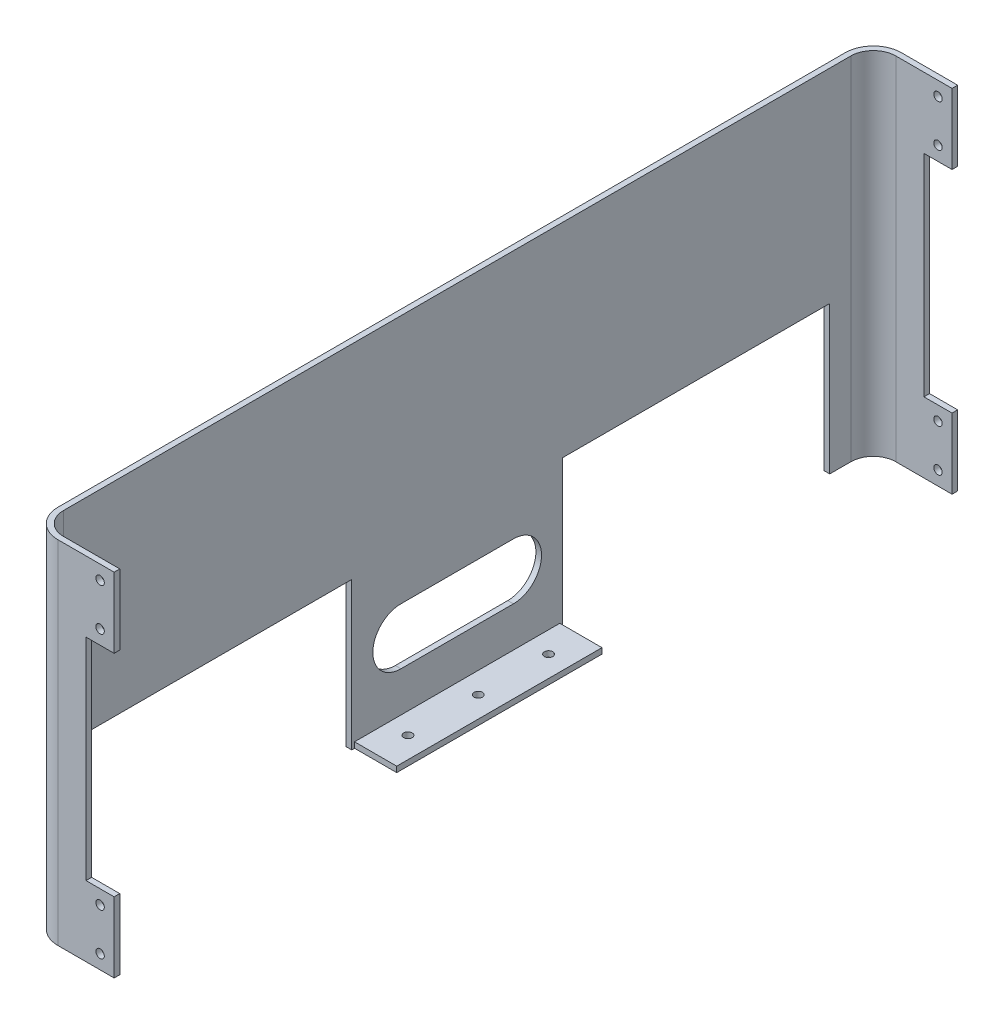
from build123d import *

# Parameters (mm, degrees)
BOSS_EXTRU_1_DEPTH      = 250
ESQUISSE2_W             = 20
ESQUISSE2_H             = 150
ENL_V_MAT_EXTRU_1_DEPTH = 4
ESQUISSE3_W             = 20
ESQUISSE3_H             = 150
ENL_V_MAT_EXTRU_2_DEPTH = 4
ESQUISSE4_W             = 23.076923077
ESQUISSE4_H             = 6.153846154
ENL_V_MAT_EXTRU_3_DEPTH = 1
ESQUISSE6_R             = 3
ENL_V_MAT_EXTRU_4_DEPTH = 4
ENL_V_START             = -4
ESQUISSE7_R             = 3
ENL_V_MAT_EXTRU_5_DEPTH = 4
ENL_V_MAT_EXTRU_6_DEPTH = 1
ESQUISSE9_W             = 190
ESQUISSE9_H             = 105
ENL_V_MAT_EXTRU_7_DEPTH = 653.407847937
ESQUISSE10_W            = 146
ESQUISSE10_H            = 4
BOSS_EXTRU_2_DEPTH      = 30
ESQUISSE11_R            = 3
ENL_V_MAT_EXTRU_8_DEPTH = 652.241890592
ENL_V_MAT_EXTRU_9_REACH = 654.763


with BuildPart() as part:
    # Esquisse1 → Boss.-Extru.1 (new body)
    with BuildSketch(Plane(origin=(0, 0, 0), x_dir=(1, 0, 0), z_dir=(0, 1, 0))):
        with BuildLine():
            Line((0, 0), (-40, 0))
            ThreePointArc((-40, 0), (-54.142135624, -5.857864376), (-60, -20))
            Line((-60, -20), (-60, -580))
            ThreePointArc((-60, -580), (-54.142135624, -594.142135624), (-40, -600))
            Line((-40, -600), (0, -600))
            Line((0, -600), (0, -596))
            Line((0, -596), (-40, -596))
            ThreePointArc((-40, -596), (-51.313708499, -591.313708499), (-56, -580))
            Line((-56, -580), (-56, -20))
            ThreePointArc((-56, -20), (-51.313708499, -8.686291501), (-40, -4))
            Line((-40, -4), (0, -4))
            Line((0, -4), (0, 0))
        make_face()
    extrude(amount=BOSS_EXTRU_1_DEPTH)

    # Esquisse2 → Enl_v. mat.-Extru.1 (cut)
    with BuildSketch(Plane.XY.offset(600)):
        with Locations((-10, 125)):
            Rectangle(ESQUISSE2_W, ESQUISSE2_H)
    extrude(amount=-ENL_V_MAT_EXTRU_1_DEPTH, mode=Mode.SUBTRACT)

    # Esquisse3 → Enl_v. mat.-Extru.2 (cut)
    with BuildSketch(Plane(origin=(0, 0, 0), x_dir=(-1, 0, 0), z_dir=(0, 0, -1))):
        with Locations((10, 125)):
            Rectangle(ESQUISSE3_W, ESQUISSE3_H)
    extrude(amount=-ENL_V_MAT_EXTRU_2_DEPTH, mode=Mode.SUBTRACT)

    # Esquisse4 → Enl_v. mat.-Extru.3 (cut)
    # profile 1 of 5: a face of its own
    with BuildSketch(Plane.ZY.offset(60)):
        Polygon((198.076923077, 235), (225.769230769, 175), (219.915865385, 175), (211.045673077, 194.230769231), (183.846153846, 194.230769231), (174.723557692, 175), (168.846153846, 175), (197.307692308, 235), align=None)
        Polygon((197.632211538, 223.305288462), (186.766826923, 200.384615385), (208.209134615, 200.384615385), align=None, mode=Mode.SUBTRACT)
    # profile 2 of 5: a face of its own
    with BuildSketch(Plane.ZY.offset(60)):
        Polygon((233.461538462, 175), (241.382211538, 235), (242.151442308, 235), (266.923076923, 185.769230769), (291.634615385, 235), (292.415865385, 235), (300.384615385, 175), (294.975961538, 175), (289.230769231, 218.173076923), (267.572115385, 175), (266.358173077, 175), (244.615384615, 218.269230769), (238.882211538, 175), align=None)
    # profile 3 of 5: a face of its own
    with BuildSketch(Plane.ZY.offset(60)):
        with BuildLine():
            Line((312.692307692, 235), (324.699519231, 235))
            add(Edge.make_bspline(
                [(324.699519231, 235), (325.50079572, 234.997332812), (327.039335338, 234.992211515), (329.243448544, 234.963655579), (331.246198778, 234.881809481), (333.046538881, 234.811376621), (334.644435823, 234.682943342), (336.044789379, 234.560189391), (337.241149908, 234.399498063), (337.965364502, 234.250262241), (338.293269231, 234.182692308)],
                knots=[0, 0, 0, 0, 1.410062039, 2.707475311, 3.878576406, 4.937260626, 5.877586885, 6.699081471, 7.410979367, 8, 8, 8, 8], degree=3))
            add(Edge.make_bspline(
                [(338.293269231, 234.182692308), (338.73223993, 234.074233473), (339.600816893, 233.859629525), (340.851389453, 233.406036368), (342.043063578, 232.881128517), (343.170889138, 232.264607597), (344.229216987, 231.551897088), (345.228959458, 230.755300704), (346.174653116, 229.879177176), (347.02805249, 228.901437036), (347.832721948, 227.875668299), (348.511384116, 226.766461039), (349.096409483, 225.606549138), (349.562189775, 224.384136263), (349.937240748, 223.111077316), (350.201690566, 221.775840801), (350.360282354, 220.3845098), (350.376428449, 219.435517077), (350.384615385, 218.954326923)],
                knots=[0, 0, 0, 0, 1.027469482, 2.033020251, 3.019912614, 3.986113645, 4.951240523, 5.91722682, 6.890402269, 7.87763091, 8.8651537, 9.85103654, 10.82876324, 11.815024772, 12.821070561, 13.842952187, 14.906261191, 16, 16, 16, 16], degree=3))
            add(Edge.make_bspline(
                [(350.384615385, 218.954326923), (350.35943256, 218.154867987), (350.310294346, 216.594916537), (349.852149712, 214.331015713), (349.101695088, 212.219198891), (348.067581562, 210.262125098), (346.750676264, 208.497942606), (345.167965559, 206.948391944), (343.318566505, 205.651707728), (341.596921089, 204.75251679), (340.076106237, 204.176638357), (338.82410659, 203.771443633), (337.458386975, 203.458381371), (335.992032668, 203.17792197), (334.418941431, 202.966178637), (332.742883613, 202.81109416), (330.96266387, 202.714167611), (329.739708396, 202.699733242), (329.110576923, 202.692307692)],
                knots=[0, 0, 0, 0, 1.260483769, 2.459530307, 3.627416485, 4.787058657, 5.939039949, 7.08810263, 8.267026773, 9.491475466, 10.141966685, 10.831826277, 11.566392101, 12.351337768, 13.187381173, 14.07005841, 15.007169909, 16, 16, 16, 16], degree=3))
            Line((329.110576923, 202.692307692), (351.153846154, 175))
            Line((351.153846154, 175), (344.495192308, 175))
            Line((344.495192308, 175), (322.451923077, 202.692307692))
            Line((322.451923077, 202.692307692), (318.076923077, 202.692307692))
            Line((318.076923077, 202.692307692), (318.076923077, 175))
            Line((318.076923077, 175), (312.692307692, 175))
            Line((312.692307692, 175), (312.692307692, 235))
        make_face()
        with BuildLine():
            Line((318.076923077, 228.846153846), (318.076923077, 208.846153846))
            Line((318.076923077, 208.846153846), (329.0625, 208.762019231))
            add(Edge.make_bspline(
                [(329.0625, 208.762019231), (329.575414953, 208.761792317), (330.569590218, 208.761352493), (332.007887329, 208.829817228), (333.347089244, 208.907702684), (334.582073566, 209.026834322), (335.713392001, 209.18036698), (336.740479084, 209.372418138), (337.665011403, 209.596167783), (338.743272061, 209.942481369), (339.947326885, 210.491155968), (341.255866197, 211.28942166), (342.370191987, 212.293463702), (343.311641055, 213.441580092), (344.068145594, 214.703915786), (344.601495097, 216.065339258), (344.939936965, 217.491480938), (344.979854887, 218.471677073), (345, 218.966346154)],
                knots=[0, 0, 0, 0, 1.146690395, 2.22261258, 3.21895312, 4.145990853, 4.996080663, 5.770904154, 6.481378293, 7.121626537, 8.300444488, 9.431385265, 10.535395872, 11.636531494, 12.74115979, 13.810798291, 14.895190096, 16, 16, 16, 16], degree=3))
            add(Edge.make_bspline(
                [(345, 218.966346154), (344.97939221, 219.448858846), (344.93855509, 220.405022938), (344.605147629, 221.804838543), (344.041329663, 223.125986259), (343.28151987, 224.363091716), (342.355820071, 225.486047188), (341.270371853, 226.446855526), (340.054854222, 227.239703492), (338.918776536, 227.746350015), (337.903332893, 228.056976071), (337.021681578, 228.275567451), (336.025484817, 228.451186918), (334.909905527, 228.591896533), (333.679706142, 228.712838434), (332.328666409, 228.794297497), (330.865750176, 228.842535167), (329.851802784, 228.844919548), (329.326923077, 228.846153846)],
                knots=[0, 0, 0, 0, 1.101028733, 2.181837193, 3.264309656, 4.369019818, 5.486613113, 6.575447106, 7.666700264, 8.788928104, 9.402425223, 10.0903467, 10.862060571, 11.710948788, 12.657782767, 13.684531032, 14.801375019, 16, 16, 16, 16], degree=3))
            Line((329.326923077, 228.846153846), (318.076923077, 228.846153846))
        make_face(mode=Mode.SUBTRACT)
    # profile 4 of 5: a face of its own
    with BuildSketch(Plane.ZY.offset(60)):
        with Locations((369.615384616, 198.076923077)):
            Rectangle(ESQUISSE4_W, ESQUISSE4_H)
    # profile 5 of 5: a face of its own
    with BuildSketch(Plane.ZY.offset(60)):
        Polygon((386.923076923, 235), (393.137019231, 235), (408.846153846, 210.456730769), (424.555288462, 235), (430.769230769, 235), (411.959134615, 205.600961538), (431.538461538, 175), (425.324519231, 175), (408.846153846, 200.745192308), (392.367788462, 175), (386.153846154, 175), (405.745192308, 205.600961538), align=None)
    extrude(amount=-ENL_V_MAT_EXTRU_3_DEPTH, mode=Mode.SUBTRACT)

    # Esquisse6 → Enl_v. mat.-Extru.4 (cut)
    with BuildSketch(Plane.XY.offset(600)):
        with Locations((-10, 240)):
            Circle(ESQUISSE6_R)
        with Locations((-10, 210)):
            Circle(ESQUISSE6_R)
        with Locations((-10, 40)):
            Circle(ESQUISSE6_R)
        with Locations((-10, 10)):
            Circle(ESQUISSE6_R)
    extrude(amount=-ENL_V_MAT_EXTRU_4_DEPTH, mode=Mode.SUBTRACT)

    # Esquisse7 → Enl_v. mat.-Extru.5 (cut)
    with BuildSketch(Plane(origin=(0, 0, 0), x_dir=(-1, 0, 0), z_dir=(0, 0, -1)).offset(ENL_V_START)):
        with Locations(Location((10, 210, 0), (0, 0, 180))):
            Circle(ESQUISSE7_R)
        with Locations(Location((10, 240, 0), (0, 0, 180))):
            Circle(ESQUISSE7_R)
        with Locations(Location((10, 10, 0), (0, 0, 180))):
            Circle(ESQUISSE7_R)
        with Locations(Location((10, 40, 0), (0, 0, 180))):
            Circle(ESQUISSE7_R)
    extrude(amount=ENL_V_MAT_EXTRU_5_DEPTH, mode=Mode.SUBTRACT)

    # Esquisse8 → Enl_v. mat.-Extru.6 (cut)
    with BuildSketch(Plane.ZY.offset(60)):
        Polygon((308.076923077, 170), (330, 170), (330, 165.384615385), (312.115384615, 165.384615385), (312.115384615, 151.538461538), (330, 151.538461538), (330, 146.923076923), (312.115384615, 146.923076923), (312.115384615, 125), (308.076923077, 125), align=None)
    extrude(amount=-ENL_V_MAT_EXTRU_6_DEPTH, mode=Mode.SUBTRACT)

    # Esquisse9 → Enl_v. mat.-Extru.7 (cut, through all)
    with BuildSketch(Plane(origin=(-56, 0, 0), x_dir=(0, 0, -1), z_dir=(1, 0, 0))):
        with Locations((-470, 52.5)):
            Rectangle(ESQUISSE9_W, ESQUISSE9_H)
        with Locations((-130, 52.5)):
            Rectangle(ESQUISSE9_W, ESQUISSE9_H)
    extrude(amount=-ENL_V_MAT_EXTRU_7_DEPTH, mode=Mode.SUBTRACT)

    # Esquisse10 → Boss.-Extru.2 (add)
    with BuildSketch(Plane(origin=(-56, 0, 0), x_dir=(0, 0, -1), z_dir=(1, 0, 0))):
        with Locations((-300, 2)):
            Rectangle(ESQUISSE10_W, ESQUISSE10_H)
    extrude(amount=BOSS_EXTRU_2_DEPTH)

    # Esquisse11 → Enl_v. mat.-Extru.8 (cut, through all)
    with BuildSketch(Plane(origin=(0, 4, 0), x_dir=(1, 0, 0), z_dir=(0, 1, 0))):
        with Locations(Location((-41, -300, 0), (0, 0, 270))):
            Circle(ESQUISSE11_R)
        with Locations(Location((-41, -350, 0), (0, 0, 270))):
            Circle(ESQUISSE11_R)
        with Locations(Location((-41, -250, 0), (0, 0, 270))):
            Circle(ESQUISSE11_R)
    extrude(amount=-ENL_V_MAT_EXTRU_8_DEPTH, mode=Mode.SUBTRACT)

    # Esquisse12 → Enl_v. mat.-Extru.9 (cut, up to next)
    with BuildSketch(Plane.ZY.offset(60), mode=Mode.PRIVATE) as enl_v_mat_extru_9_sk1:
        with BuildLine():
            Line((260, 72.5), (340, 72.5))
            ThreePointArc((340, 72.5), (360, 52.5), (340, 32.5))
            Line((340, 32.5), (260, 32.5))
            ThreePointArc((260, 32.5), (240, 52.5), (260, 72.5))
        make_face()
    enl_v_mat_extru_9_tool1 = extrude(enl_v_mat_extru_9_sk1.sketch, amount=-ENL_V_MAT_EXTRU_9_REACH, mode=Mode.PRIVATE) & part.part
    add(enl_v_mat_extru_9_tool1.solids().sort_by_distance((-60, 52.5, 300))[0], mode=Mode.SUBTRACT)


solid = part.part
